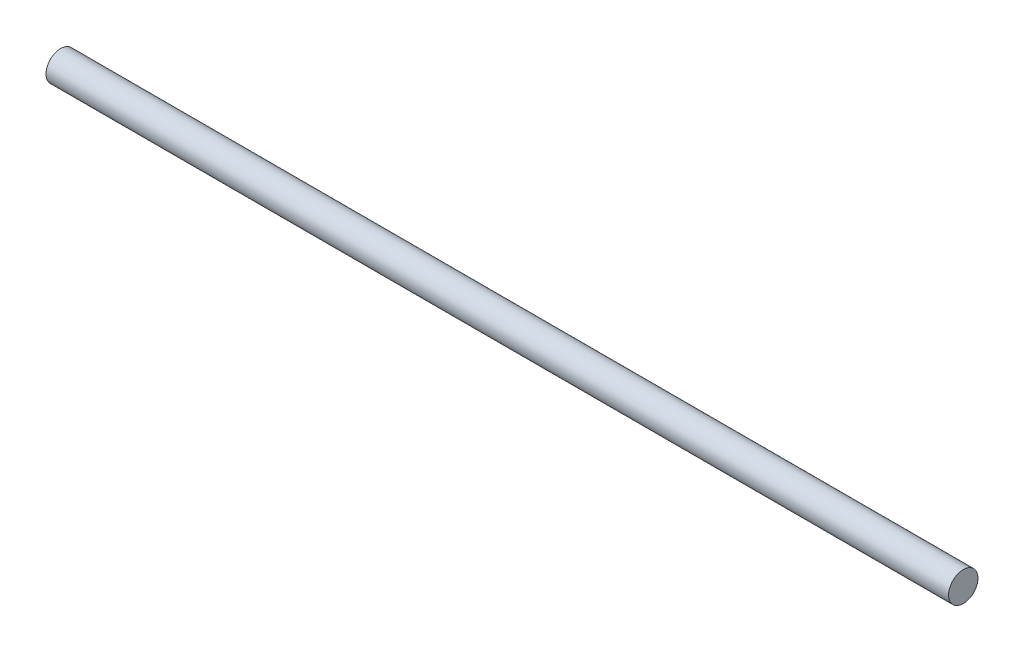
ISO-10303-21;
HEADER;
FILE_DESCRIPTION(('STEP AP214'),'2;1');
FILE_NAME('part.step','',(''),(''),'','','');
FILE_SCHEMA(('AUTOMOTIVE_DESIGN { 1 0 10303 214 1 1 1 1 }'));
ENDSEC;
DATA;
#1=APPLICATION_CONTEXT('core data for automotive mechanical design processes');
#2=APPLICATION_PROTOCOL_DEFINITION('international standard','automotive_design',2000,#1);
#3=PRODUCT_CONTEXT('',#1,'mechanical');
#4=PRODUCT('Part','Part','',(#3));
#5=PRODUCT_RELATED_PRODUCT_CATEGORY('part','',(#4));
#6=PRODUCT_DEFINITION_FORMATION('','',#4);
#7=PRODUCT_DEFINITION_CONTEXT('part definition',#1,'design');
#8=PRODUCT_DEFINITION('design','',#6,#7);
#9=PRODUCT_DEFINITION_SHAPE('','',#8);
#10=(LENGTH_UNIT() NAMED_UNIT(*) SI_UNIT(.MILLI.,.METRE.));
#11=(NAMED_UNIT(*) PLANE_ANGLE_UNIT() SI_UNIT($,.RADIAN.));
#12=(NAMED_UNIT(*) SI_UNIT($,.STERADIAN.) SOLID_ANGLE_UNIT());
#13=UNCERTAINTY_MEASURE_WITH_UNIT(LENGTH_MEASURE(1.E-05),#10,'distance_accuracy_value','');
#14=(GEOMETRIC_REPRESENTATION_CONTEXT(3) GLOBAL_UNCERTAINTY_ASSIGNED_CONTEXT((#13)) GLOBAL_UNIT_ASSIGNED_CONTEXT((#10,
#11,#12)) REPRESENTATION_CONTEXT('',''));
#15=CARTESIAN_POINT('',(0.,0.,0.));
#16=DIRECTION('',(0.,0.,1.));
#17=DIRECTION('',(1.,0.,0.));
#18=AXIS2_PLACEMENT_3D('',#15,#16,#17);
#19=CARTESIAN_POINT('',(73.025,0.,0.));
#20=DIRECTION('',(-1.,0.,0.));
#21=DIRECTION('',(0.,0.,1.));
#22=AXIS2_PLACEMENT_3D('',#19,#20,#21);
#23=CYLINDRICAL_SURFACE('',#22,2.38125);
#24=CARTESIAN_POINT('',(73.025,0.,0.));
#25=DIRECTION('',(1.,0.,0.));
#26=DIRECTION('',(0.,0.,-1.));
#27=AXIS2_PLACEMENT_3D('',#24,#25,#26);
#28=CIRCLE('',#27,2.38125);
#29=CARTESIAN_POINT('',(73.025,0.,-2.38125));
#30=VERTEX_POINT('',#29);
#31=EDGE_CURVE('E10',#30,#30,#28,.T.);
#32=ORIENTED_EDGE('',*,*,#31,.F.);
#33=EDGE_LOOP('',(#32));
#34=FACE_BOUND('',#33,.T.);
#35=CARTESIAN_POINT('',(-73.025,0.,0.));
#36=DIRECTION('',(1.,0.,0.));
#37=DIRECTION('',(0.,0.,-1.));
#38=AXIS2_PLACEMENT_3D('',#35,#36,#37);
#39=CIRCLE('',#38,2.38125);
#40=CARTESIAN_POINT('',(-73.025,0.,-2.38125));
#41=VERTEX_POINT('',#40);
#42=EDGE_CURVE('E35',#41,#41,#39,.T.);
#43=ORIENTED_EDGE('',*,*,#42,.T.);
#44=EDGE_LOOP('',(#43));
#45=FACE_BOUND('',#44,.T.);
#46=ADVANCED_FACE('F32',(#34,#45),#23,.T.);
#47=CARTESIAN_POINT('',(73.025,0.,0.));
#48=DIRECTION('',(1.,0.,0.));
#49=DIRECTION('',(0.,0.,-1.));
#50=AXIS2_PLACEMENT_3D('',#47,#48,#49);
#51=PLANE('',#50);
#52=ORIENTED_EDGE('',*,*,#31,.T.);
#53=EDGE_LOOP('',(#52));
#54=FACE_BOUND('',#53,.T.);
#55=ADVANCED_FACE('F47',(#54),#51,.T.);
#56=CARTESIAN_POINT('',(-73.025,0.,0.));
#57=DIRECTION('',(1.,0.,0.));
#58=DIRECTION('',(0.,0.,-1.));
#59=AXIS2_PLACEMENT_3D('',#56,#57,#58);
#60=PLANE('',#59);
#61=ORIENTED_EDGE('',*,*,#42,.F.);
#62=EDGE_LOOP('',(#61));
#63=FACE_BOUND('',#62,.T.);
#64=ADVANCED_FACE('F45',(#63),#60,.F.);
#65=CLOSED_SHELL('',(#46,#55,#64));
#66=MANIFOLD_SOLID_BREP('B2',#65);
#67=ADVANCED_BREP_SHAPE_REPRESENTATION('',(#18,#66),#14);
#68=SHAPE_DEFINITION_REPRESENTATION(#9,#67);
ENDSEC;
END-ISO-10303-21;
